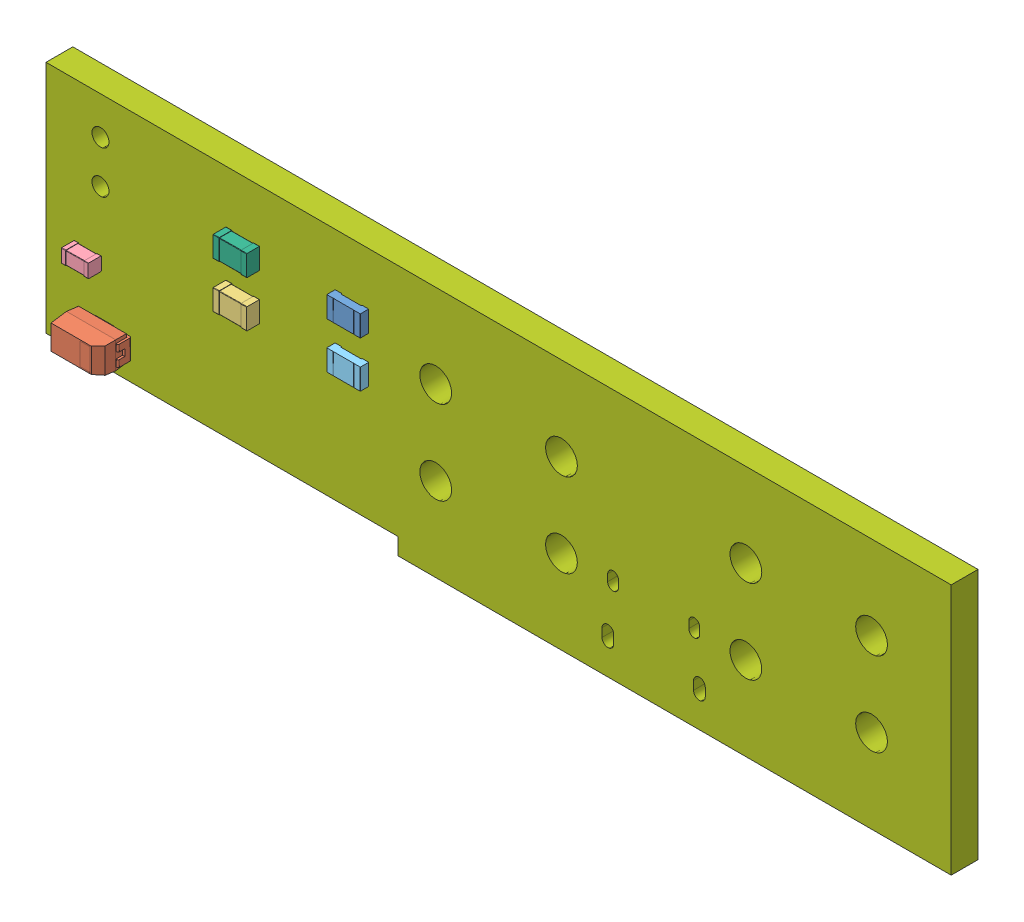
SolidWorks assembly test.sldasm, configuration Default (file format 10000). Lengths in mm.
Overall size (54 15 3.4).
7 component instances, 7 part files, 0 mates.
Components (placement in the parent):
- R_0805_001-1: R_0805_001.sldprt [Default] at (-8.75 3.75 0) x (-1 0 0) z (0 0 1) size (2 1.25 0.5)
- CP_Tantalum_Case-A_EIA-3216-18_-1: CP_Tantalum_Case-A_EIA-3216-18_.sldprt [Default] at (-23.5 -4.75 0) x (-1 0 0) z (0 0 1) size (3.2 1.6 1.8)
- C_0805_001-1: C_0805_001.sldprt [Default] at (-15.25 1 0) x (-1 0 0) z (0 0 1) size (2 1.25 0.78)
- C_0603_-1: C_0603_.sldprt [Default] at (-24.5 -1.25 0) size (1.6 0.81 0.78)
- R_0805_-1: R_0805_.sldprt [Default] at (-8.75 1 0) x (-1 0 0) z (0 0 1) size (2 1.25 0.5)
- C_0805_-1: C_0805_.sldprt [Default] at (-15.25 3.75 0) size (2 1.25 0.78)
- Pcb-1: Pcb.sldprt [Default] at (-141 107.75 0) size (54 15 1.6)
